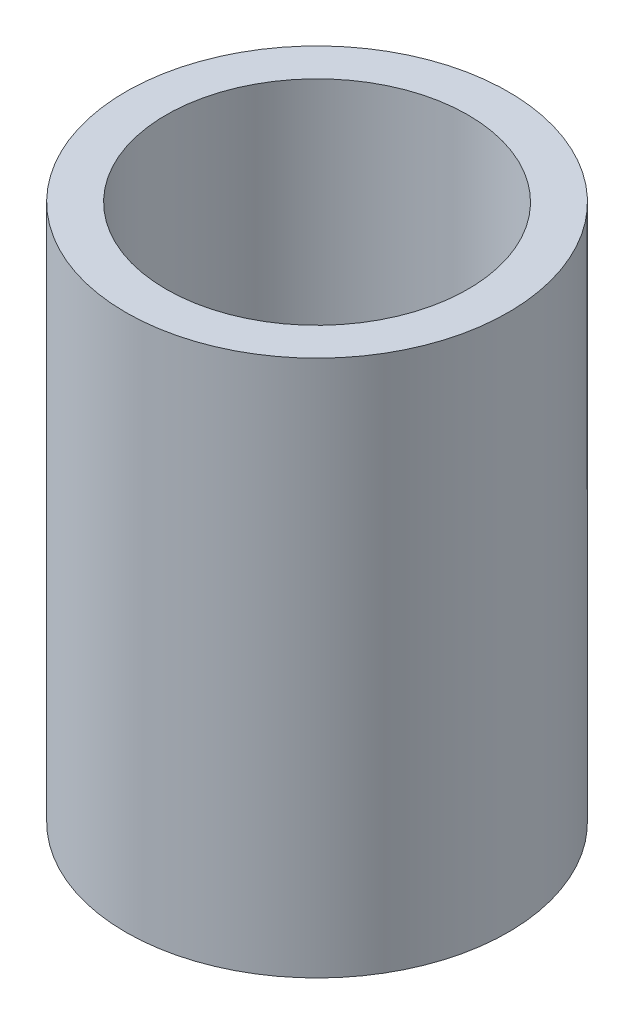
from build123d import *

# Parameters (mm, degrees)
SKETCH1_R           = 1.4478
SKETCH1_R_2         = 1.143
BOSS_EXTRUDE1_DEPTH = 4.064


with BuildPart() as part:
    # Sketch1 → Boss-Extrude1 (new body)
    with BuildSketch(Plane(origin=(0, 0, 0), x_dir=(1, 0, 0), z_dir=(0, 1, 0))):
        with Locations(Location((0, 0, 0), (0, 0, 270))):
            Circle(SKETCH1_R)
        with Locations(Location((0, 0, 0), (0, 0, 270))):
            Circle(SKETCH1_R_2, mode=Mode.SUBTRACT)
    extrude(amount=BOSS_EXTRUDE1_DEPTH)


solid = part.part
